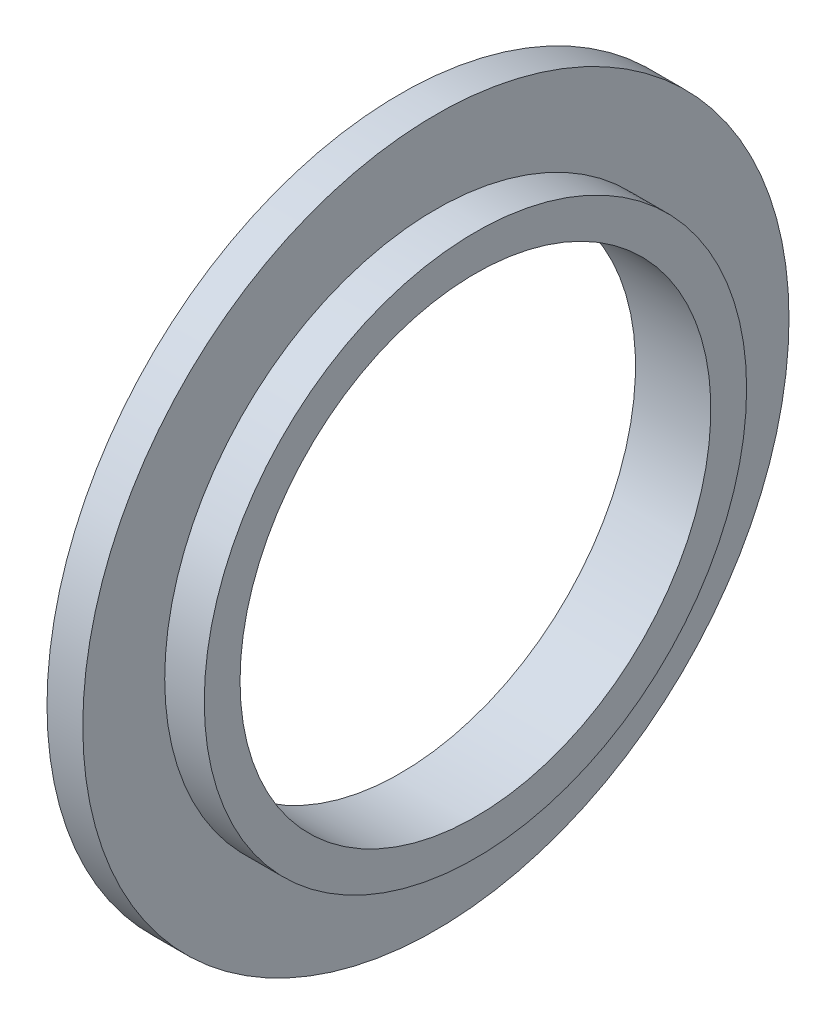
ISO-10303-21;
HEADER;
FILE_DESCRIPTION(('STEP AP214'),'2;1');
FILE_NAME('part.step','',(''),(''),'','','');
FILE_SCHEMA(('AUTOMOTIVE_DESIGN { 1 0 10303 214 1 1 1 1 }'));
ENDSEC;
DATA;
#1=APPLICATION_CONTEXT('core data for automotive mechanical design processes');
#2=APPLICATION_PROTOCOL_DEFINITION('international standard','automotive_design',2000,#1);
#3=PRODUCT_CONTEXT('',#1,'mechanical');
#4=PRODUCT('Part','Part','',(#3));
#5=PRODUCT_RELATED_PRODUCT_CATEGORY('part','',(#4));
#6=PRODUCT_DEFINITION_FORMATION('','',#4);
#7=PRODUCT_DEFINITION_CONTEXT('part definition',#1,'design');
#8=PRODUCT_DEFINITION('design','',#6,#7);
#9=PRODUCT_DEFINITION_SHAPE('','',#8);
#10=(LENGTH_UNIT() NAMED_UNIT(*) SI_UNIT(.MILLI.,.METRE.));
#11=(NAMED_UNIT(*) PLANE_ANGLE_UNIT() SI_UNIT($,.RADIAN.));
#12=(NAMED_UNIT(*) SI_UNIT($,.STERADIAN.) SOLID_ANGLE_UNIT());
#13=UNCERTAINTY_MEASURE_WITH_UNIT(LENGTH_MEASURE(1.E-05),#10,'distance_accuracy_value','');
#14=(GEOMETRIC_REPRESENTATION_CONTEXT(3) GLOBAL_UNCERTAINTY_ASSIGNED_CONTEXT((#13)) GLOBAL_UNIT_ASSIGNED_CONTEXT((#10,
#11,#12)) REPRESENTATION_CONTEXT('',''));
#15=CARTESIAN_POINT('',(0.,0.,0.));
#16=DIRECTION('',(0.,0.,1.));
#17=DIRECTION('',(1.,0.,0.));
#18=AXIS2_PLACEMENT_3D('',#15,#16,#17);
#19=CARTESIAN_POINT('',(-20.,0.,0.));
#20=DIRECTION('',(-1.,0.,0.));
#21=DIRECTION('',(0.,0.,1.));
#22=AXIS2_PLACEMENT_3D('',#19,#20,#21);
#23=CYLINDRICAL_SURFACE('',#22,25.);
#24=CARTESIAN_POINT('',(8.,0.,0.));
#25=DIRECTION('',(-1.,0.,0.));
#26=DIRECTION('',(0.,0.,1.));
#27=AXIS2_PLACEMENT_3D('',#24,#25,#26);
#28=CIRCLE('',#27,25.);
#29=CARTESIAN_POINT('',(8.,0.,25.));
#30=VERTEX_POINT('',#29);
#31=EDGE_CURVE('E10',#30,#30,#28,.T.);
#32=ORIENTED_EDGE('',*,*,#31,.F.);
#33=EDGE_LOOP('',(#32));
#34=FACE_BOUND('',#33,.T.);
#35=CARTESIAN_POINT('',(0.,0.,0.));
#36=DIRECTION('',(-1.,0.,0.));
#37=DIRECTION('',(0.,0.,1.));
#38=AXIS2_PLACEMENT_3D('',#35,#36,#37);
#39=CIRCLE('',#38,25.);
#40=CARTESIAN_POINT('',(0.,0.,25.));
#41=VERTEX_POINT('',#40);
#42=EDGE_CURVE('E52',#41,#41,#39,.T.);
#43=ORIENTED_EDGE('',*,*,#42,.T.);
#44=EDGE_LOOP('',(#43));
#45=FACE_BOUND('',#44,.T.);
#46=ADVANCED_FACE('F30',(#34,#45),#23,.F.);
#47=CARTESIAN_POINT('',(8.,28.8,0.));
#48=DIRECTION('',(1.,0.,0.));
#49=DIRECTION('',(0.,0.,-1.));
#50=AXIS2_PLACEMENT_3D('',#47,#48,#49);
#51=PLANE('',#50);
#52=ORIENTED_EDGE('',*,*,#31,.T.);
#53=EDGE_LOOP('',(#52));
#54=FACE_BOUND('',#53,.T.);
#55=CARTESIAN_POINT('',(8.,0.,0.));
#56=DIRECTION('',(-1.,0.,0.));
#57=DIRECTION('',(0.,0.,1.));
#58=AXIS2_PLACEMENT_3D('',#55,#56,#57);
#59=CIRCLE('',#58,28.8);
#60=CARTESIAN_POINT('',(8.,0.,28.8));
#61=VERTEX_POINT('',#60);
#62=EDGE_CURVE('E36',#61,#61,#59,.T.);
#63=ORIENTED_EDGE('',*,*,#62,.F.);
#64=EDGE_LOOP('',(#63));
#65=FACE_BOUND('',#64,.T.);
#66=ADVANCED_FACE('F75',(#54,#65),#51,.T.);
#67=CARTESIAN_POINT('',(-20.,0.,0.));
#68=DIRECTION('',(-1.,0.,0.));
#69=DIRECTION('',(0.,0.,1.));
#70=AXIS2_PLACEMENT_3D('',#67,#68,#69);
#71=CYLINDRICAL_SURFACE('',#70,28.8);
#72=ORIENTED_EDGE('',*,*,#62,.T.);
#73=EDGE_LOOP('',(#72));
#74=FACE_BOUND('',#73,.T.);
#75=CARTESIAN_POINT('',(3.8,0.,0.));
#76=DIRECTION('',(-1.,0.,0.));
#77=DIRECTION('',(0.,0.,1.));
#78=AXIS2_PLACEMENT_3D('',#75,#76,#77);
#79=CIRCLE('',#78,28.8);
#80=CARTESIAN_POINT('',(3.8,0.,28.8));
#81=VERTEX_POINT('',#80);
#82=EDGE_CURVE('E40',#81,#81,#79,.T.);
#83=ORIENTED_EDGE('',*,*,#82,.F.);
#84=EDGE_LOOP('',(#83));
#85=FACE_BOUND('',#84,.T.);
#86=ADVANCED_FACE('F71',(#74,#85),#71,.T.);
#87=CARTESIAN_POINT('',(3.8,25.,0.));
#88=DIRECTION('',(1.,0.,0.));
#89=DIRECTION('',(0.,0.,-1.));
#90=AXIS2_PLACEMENT_3D('',#87,#88,#89);
#91=PLANE('',#90);
#92=ORIENTED_EDGE('',*,*,#82,.T.);
#93=EDGE_LOOP('',(#92));
#94=FACE_BOUND('',#93,.T.);
#95=CARTESIAN_POINT('',(3.8,0.,0.));
#96=DIRECTION('',(-1.,0.,0.));
#97=DIRECTION('',(0.,0.,1.));
#98=AXIS2_PLACEMENT_3D('',#95,#96,#97);
#99=CIRCLE('',#98,37.5);
#100=CARTESIAN_POINT('',(3.8,0.,37.5));
#101=VERTEX_POINT('',#100);
#102=EDGE_CURVE('E44',#101,#101,#99,.T.);
#103=ORIENTED_EDGE('',*,*,#102,.F.);
#104=EDGE_LOOP('',(#103));
#105=FACE_BOUND('',#104,.T.);
#106=ADVANCED_FACE('F65',(#94,#105),#91,.T.);
#107=CARTESIAN_POINT('',(-20.,0.,0.));
#108=DIRECTION('',(-1.,0.,0.));
#109=DIRECTION('',(0.,0.,1.));
#110=AXIS2_PLACEMENT_3D('',#107,#108,#109);
#111=CYLINDRICAL_SURFACE('',#110,37.5);
#112=ORIENTED_EDGE('',*,*,#102,.T.);
#113=EDGE_LOOP('',(#112));
#114=FACE_BOUND('',#113,.T.);
#115=CARTESIAN_POINT('',(0.,0.,0.));
#116=DIRECTION('',(-1.,0.,0.));
#117=DIRECTION('',(0.,0.,1.));
#118=AXIS2_PLACEMENT_3D('',#115,#116,#117);
#119=CIRCLE('',#118,37.5);
#120=CARTESIAN_POINT('',(0.,0.,37.5));
#121=VERTEX_POINT('',#120);
#122=EDGE_CURVE('E49',#121,#121,#119,.T.);
#123=ORIENTED_EDGE('',*,*,#122,.F.);
#124=EDGE_LOOP('',(#123));
#125=FACE_BOUND('',#124,.T.);
#126=ADVANCED_FACE('F60',(#114,#125),#111,.T.);
#127=CARTESIAN_POINT('',(0.,25.,0.));
#128=DIRECTION('',(1.,0.,0.));
#129=DIRECTION('',(0.,0.,-1.));
#130=AXIS2_PLACEMENT_3D('',#127,#128,#129);
#131=PLANE('',#130);
#132=ORIENTED_EDGE('',*,*,#42,.F.);
#133=EDGE_LOOP('',(#132));
#134=FACE_BOUND('',#133,.T.);
#135=ORIENTED_EDGE('',*,*,#122,.T.);
#136=EDGE_LOOP('',(#135));
#137=FACE_BOUND('',#136,.T.);
#138=ADVANCED_FACE('F57',(#134,#137),#131,.F.);
#139=CLOSED_SHELL('',(#46,#66,#86,#106,#126,#138));
#140=MANIFOLD_SOLID_BREP('B2',#139);
#141=ADVANCED_BREP_SHAPE_REPRESENTATION('',(#18,#140),#14);
#142=SHAPE_DEFINITION_REPRESENTATION(#9,#141);
ENDSEC;
END-ISO-10303-21;
